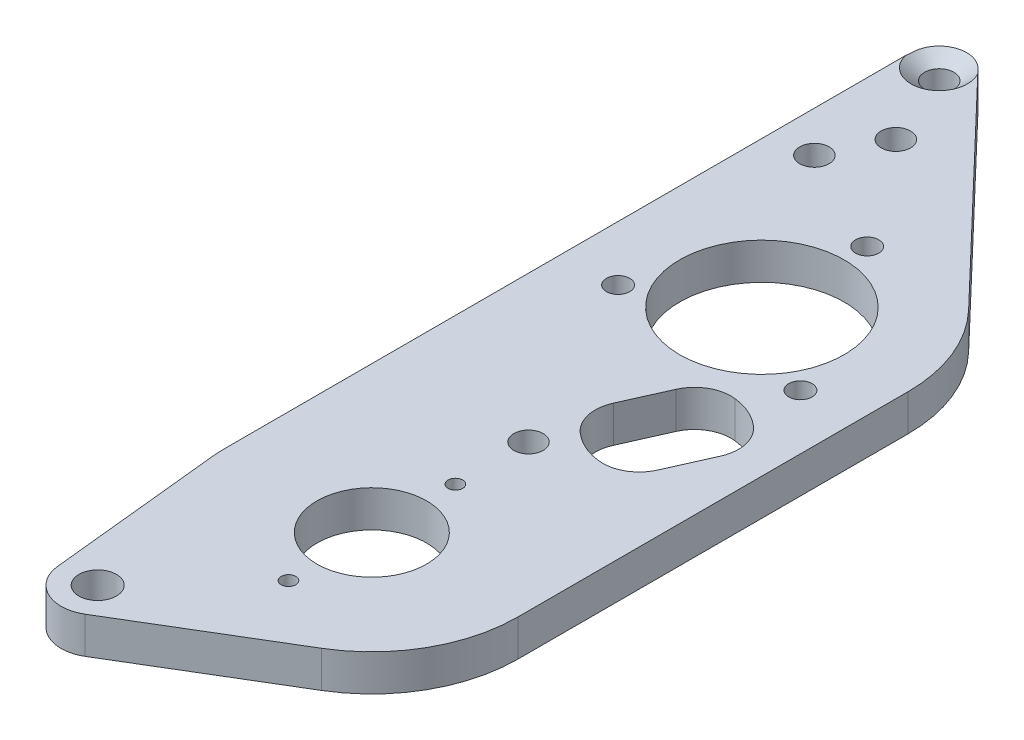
from build123d import *

# Parameters (mm, degrees)
SKETCH1_R                                          = 14.2875
SKETCH1_R_2                                        = 9.525
SKETCH1_R_3                                        = 3.2639
BOSS_EXTRUDE1_DEPTH                                = 6.35
F_1_4_20_TAPPED_HOLE1_D                            = 5.1054
FILLET1_R                                          = 19.05
CUT_EXTRUDE1_DEPTH                                 = 161.769159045
SKETCH4_R                                          = 2.5527
BOSS_EXTRUDE2_DEPTH                                = 6.35
SKETCH5_R                                          = 1.27
SKETCH5_R_2                                        = 2.5527
CUT_EXTRUDE2_DEPTH                                 = 161.769159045
CUT_EXTRUDE3_DEPTH                                 = 161.769159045
CSK_FOR_10_FLAT_HEAD_MACHINE_SCREW_100_D           = 4.9784
CSK_FOR_10_FLAT_HEAD_MACHINE_SCREW_100_DEPTH       = 4.826
CSK_FOR_10_FLAT_HEAD_MACHINE_SCREW_100_CSINK_D     = 9.779
CSK_FOR_10_FLAT_HEAD_MACHINE_SCREW_100_CSINK_ANGLE = 100
CSK_FOR_10_FLAT_HEAD_MACHINE_SCREW_100_TIP         = 1.495662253
CUT_EXTRUDE4_DEPTH                                 = 161.769159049
FILLET2_R                                          = 6.35
F_10_32_TAPPED_HOLE1_D                             = 4.0386


with BuildPart() as part:
    # Sketch1 → Boss-Extrude1 (new body)
    with BuildSketch(Plane(origin=(0, 0, 0), x_dir=(1, 0, 0), z_dir=(0, 1, 0))):
        Polygon((0, 0), (50.8, 0), (50.8, -152.4), (25.4, -152.4), (0, -152.4), align=None)
        with Locations(Location((25.4, -46.5328, 0), (0, 0, 270))):
            Circle(SKETCH1_R, mode=Mode.SUBTRACT)
        with Locations(Location((25.4, -114.3, 0), (0, 0, 270))):
            Circle(SKETCH1_R_2, mode=Mode.SUBTRACT)
        with Locations(Location((9.525, -146.05, 0), (0, 0, 270))):
            Circle(SKETCH1_R_3, mode=Mode.SUBTRACT)
    extrude(amount=BOSS_EXTRUDE1_DEPTH)

    # 1_4-20 Tapped Hole1 (through all)
    with Locations(Plane(origin=(7.099515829, 6.35, 19.108793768), x_dir=(0, 0, 1), z_dir=(0, 1, 0))):
        with Locations((0, 0), (-9.456793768, 4.686792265)):
            Hole(F_1_4_20_TAPPED_HOLE1_D / 2)

    # Fillet1
    fillet1_edges = [part.edges().sort_by_distance(p)[0] for p in [
        (50.8, 3.175, 152.4),
    ]]
    fillet(fillet1_edges, radius=FILLET1_R)

    # Sketch3 → Cut-Extrude1 (cut, through all)
    with BuildSketch(Plane.XZ):
        Polygon((50.8, 0), (31.75, 0), (50.8, 31.75), align=None)
    extrude(amount=-CUT_EXTRUDE1_DEPTH, mode=Mode.SUBTRACT)

    # Sketch4 → Boss-Extrude2 (add)
    with BuildSketch(Plane.XZ):
        with BuildLine():
            Line((31.75, 0), (0, 0))
            Line((0, 0), (0, -4.913667))
            ThreePointArc((0, -4.913667), (2.04164711, -8.822422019), (6.416111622, -9.379870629))
            Line((6.416111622, -9.379870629), (31.75, 0))
        make_face()
        with Locations(Location((4.7625, -4.913667, 0), (0, 0, 270))):
            Circle(SKETCH4_R, mode=Mode.SUBTRACT)
    extrude(amount=-BOSS_EXTRUDE2_DEPTH)

    # Sketch5 → Cut-Extrude2 (cut, through all)
    with BuildSketch(Plane.XZ):
        with Locations(Location((25.4, 128.778, 0), (0, 0, 270))):
            Circle(SKETCH5_R)
        with Locations(Location((25.4, 99.77882, 0), (0, 0, 270))):
            Circle(SKETCH5_R)
        with Locations(Location((25.4, 87.07882, 0), (0, 0, 270))):
            Circle(SKETCH5_R_2)
    extrude(amount=-CUT_EXTRUDE2_DEPTH, mode=Mode.SUBTRACT)

    # Sketch6 → Cut-Extrude3 (cut, through all)
    with BuildSketch(Plane.XZ):
        with BuildLine():
            ThreePointArc((9.524999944, 152.4), (11.220823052, 152.16936959), (12.793462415, 151.494231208))
            Line((12.793462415, 151.494231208), (38.47384966, 136.07692483))
            ThreePointArc((38.47384966, 136.07692483), (47.504702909, 126.811678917), (50.8, 114.3))
            Line((50.8, 114.3), (50.8, 133.35))
            ThreePointArc((50.8, 133.35), (45.220384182, 146.820384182), (31.75, 152.4))
            Line((31.75, 152.4), (9.524999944, 152.4))
        make_face()
        with BuildLine():
            ThreePointArc((3.208537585, 146.701768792), (5.271544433, 150.764935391), (9.524999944, 152.4))
            Line((9.524999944, 152.4), (0, 152.4))
            Line((0, 152.4), (0, 114.300000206))
            ThreePointArc((0, 114.300000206), (0.033559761, 115.605262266), (0.13415034, 116.90707517))
            Line((0.13415034, 116.90707517), (3.208537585, 146.701768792))
        make_face()
        with BuildLine():
            Line((50.8, 31.75), (50.8, 46.5328))
            ThreePointArc((50.8, 46.5328), (48.9739877, 37.076209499), (43.758495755, 28.97929227))
            Line((43.758495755, 28.97929227), (8.204717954, -8.204949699))
            ThreePointArc((8.204717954, -8.204949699), (7.377261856, -8.894172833), (6.416111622, -9.379870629))
            Line((6.416111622, -9.379870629), (31.75, 0))
            Line((31.75, 0), (50.8, 31.75))
        make_face()
    extrude(amount=-CUT_EXTRUDE3_DEPTH, mode=Mode.SUBTRACT)

    # CSK for _10 Flat Head Machine Screw _100
    with Locations(Plane(origin=(0, 6.35, 0), x_dir=(1, 0, 0), z_dir=(0, 1, 0))):
        with Locations((4.7625, 4.913667)):
            CounterSinkHole(CSK_FOR_10_FLAT_HEAD_MACHINE_SCREW_100_D / 2, CSK_FOR_10_FLAT_HEAD_MACHINE_SCREW_100_CSINK_D / 2, depth=CSK_FOR_10_FLAT_HEAD_MACHINE_SCREW_100_DEPTH, counter_sink_angle=CSK_FOR_10_FLAT_HEAD_MACHINE_SCREW_100_CSINK_ANGLE)
            with Locations((0, 0, -(CSK_FOR_10_FLAT_HEAD_MACHINE_SCREW_100_DEPTH + CSK_FOR_10_FLAT_HEAD_MACHINE_SCREW_100_TIP / 2))):  # 118° drill point
                Cone(0, CSK_FOR_10_FLAT_HEAD_MACHINE_SCREW_100_D / 2, CSK_FOR_10_FLAT_HEAD_MACHINE_SCREW_100_TIP, mode=Mode.SUBTRACT)

    # Sketch11 → Cut-Extrude4 (cut, through all)
    with BuildSketch(Plane.XZ):
        with BuildLine():
            Line((31.635497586, 63.282895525), (25.56206964, 76.924038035))
            ThreePointArc((25.56206964, 76.924038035), (31.220933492, 82.948502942), (39.484502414, 83.122704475))
            Line((39.484502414, 83.122704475), (45.55793036, 69.481561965))
            ThreePointArc((45.55793036, 69.481561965), (39.899066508, 63.457097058), (31.635497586, 63.282895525))
        make_face()
    extrude(amount=-CUT_EXTRUDE4_DEPTH, mode=Mode.SUBTRACT)

    # Fillet2
    fillet2_edges = [part.edges().sort_by_distance(p)[0] for p in [
        (45.55793036, 3.175, 69.481561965),
        (31.635497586, 3.175, 63.282895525),
        (25.56206964, 3.175, 76.924038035),
        (39.484502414, 3.175, 83.122704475),
    ]]
    fillet(fillet2_edges, radius=FILLET2_R)

    # 10-32 Tapped Hole1 (through all)
    with Locations(Plane(origin=(9.562127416, 6.35, 55.6768), x_dir=(0, 0, 1), z_dir=(0, 1, 0))):
        with Locations((0, 0), (-27.432, 15.837872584), (0, 31.675745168)):
            Hole(F_10_32_TAPPED_HOLE1_D / 2)


solid = part.part
